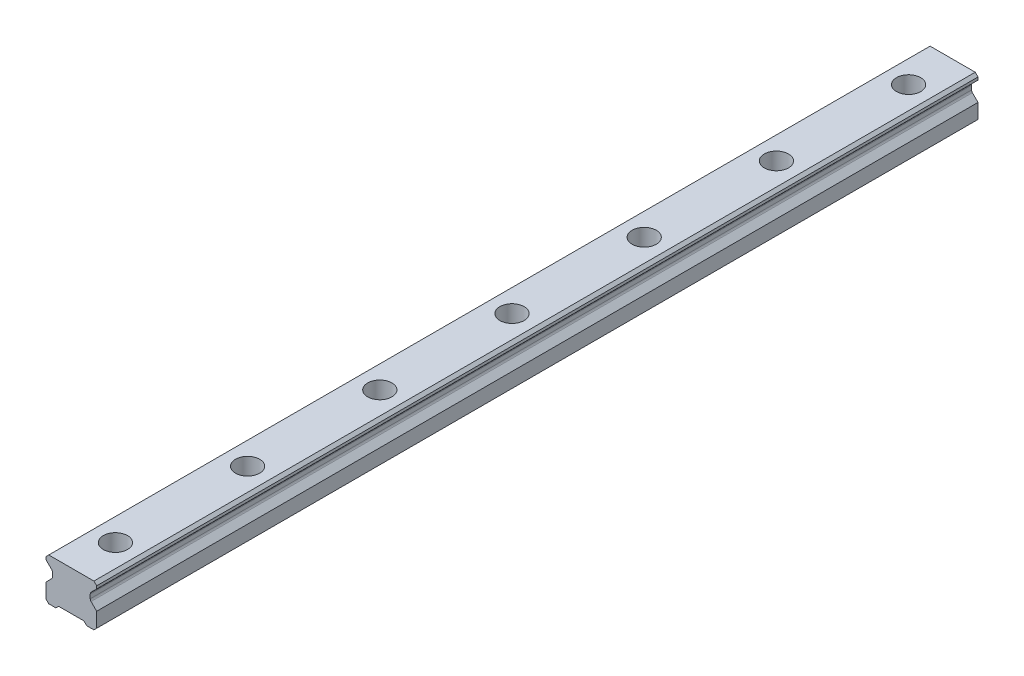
from build123d import *

# Parameters (mm, degrees)
SKETCH1_W           = 23
SKETCH1_H           = 19.2
BOSS_EXTRUDE1_DEPTH = 200
CUT_EXTRUDE1_DEPTH  = 401.625623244
CHAMFER1_SIZE       = 1.25
FILLET1_R           = 1.25
CUT_EXTRUDE2_DEPTH  = 401.625623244
SKETCH4_R           = 5.5
SKETCH4_R_2         = 3.5
CUT_EXTRUDE3_DEPTH  = 9
SKETCH4_2_R         = 3.5
CUT_EXTRUDE4_DEPTH  = 202.248329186
LPATTERN1_COUNT     = 7
LPATTERN1_PITCH     = 60


with BuildPart() as part:
    # Sketch1 → Boss-Extrude1 (new, symmetric)
    with BuildSketch(Plane.XY):
        with Locations((0, 9.6)):
            Rectangle(SKETCH1_W, SKETCH1_H)
    extrude(amount=BOSS_EXTRUDE1_DEPTH, both=True)

    # Sketch2 → Cut-Extrude1 (cut, through all)
    with BuildSketch(Plane.XY.offset(200)):
        Polygon((-11.5, 16.7), (-11.5, 7.95), (-8.583333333, 10.866666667), (-8.583333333, 13.783333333), align=None)
        Polygon((8.583333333, 13.783333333), (11.5, 16.7), (11.5, 7.95), (8.583333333, 10.866666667), align=None)
    extrude(amount=-CUT_EXTRUDE1_DEPTH, mode=Mode.SUBTRACT)

    # Chamfer1
    chamfer1_edges = [part.edges().sort_by_distance(p)[0] for p in [
        (-11.5, 19.2, 0),
        (11.5, 19.2, 0),
        (11.5, 0, 0),
        (-11.5, 0, 0),
    ]]
    chamfer(chamfer1_edges, length=CHAMFER1_SIZE)

    # Fillet1
    fillet1_edges = [part.edges().sort_by_distance(p)[0] for p in [
        (-8.583333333, 13.783333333, 0),
        (-8.583333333, 10.866666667, 0),
        (8.583333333, 10.866666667, 0),
        (8.583333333, 13.783333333, 0),
    ]]
    fillet(fillet1_edges, radius=FILLET1_R)

    # Sketch3 → Cut-Extrude2 (cut, through all)
    with BuildSketch(Plane.XY.offset(200)):
        Polygon((-7, 0), (-5.75, 1.25), (5.75, 1.25), (7, 0), align=None)
    extrude(amount=-CUT_EXTRUDE2_DEPTH, mode=Mode.SUBTRACT)

    # Sketch4 → Cut-Extrude3 (cut)
    with BuildSketch(Plane(origin=(0, 19.2, 0), x_dir=(1, 0, 0), z_dir=(0, 1, 0))):
        with Locations(Location((0, -180, 0), (0, 0, 270))):
            Circle(SKETCH4_R)
        with Locations(Location((0, -180, 0), (0, 0, 270))):
            Circle(SKETCH4_R_2, mode=Mode.SUBTRACT)
    cut_extrude3 = extrude(amount=-CUT_EXTRUDE3_DEPTH, mode=Mode.SUBTRACT)

    # Sketch4_2 → Cut-Extrude4 (cut, through all)
    with BuildSketch(Plane(origin=(0, 19.2, 0), x_dir=(1, 0, 0), z_dir=(0, 1, 0))):
        with Locations(Location((0, -180, 0), (0, 0, 270))):
            Circle(SKETCH4_2_R)
    cut_extrude4 = extrude(amount=-CUT_EXTRUDE4_DEPTH, mode=Mode.SUBTRACT)

    # LPattern1: Cut-Extrude3, Cut-Extrude4 ×7
    with Locations(*[(0, 0, -i * LPATTERN1_PITCH) for i in range(1, LPATTERN1_COUNT)]):
        add(cut_extrude3, mode=Mode.SUBTRACT)
        add(cut_extrude4, mode=Mode.SUBTRACT)


solid = part.part
